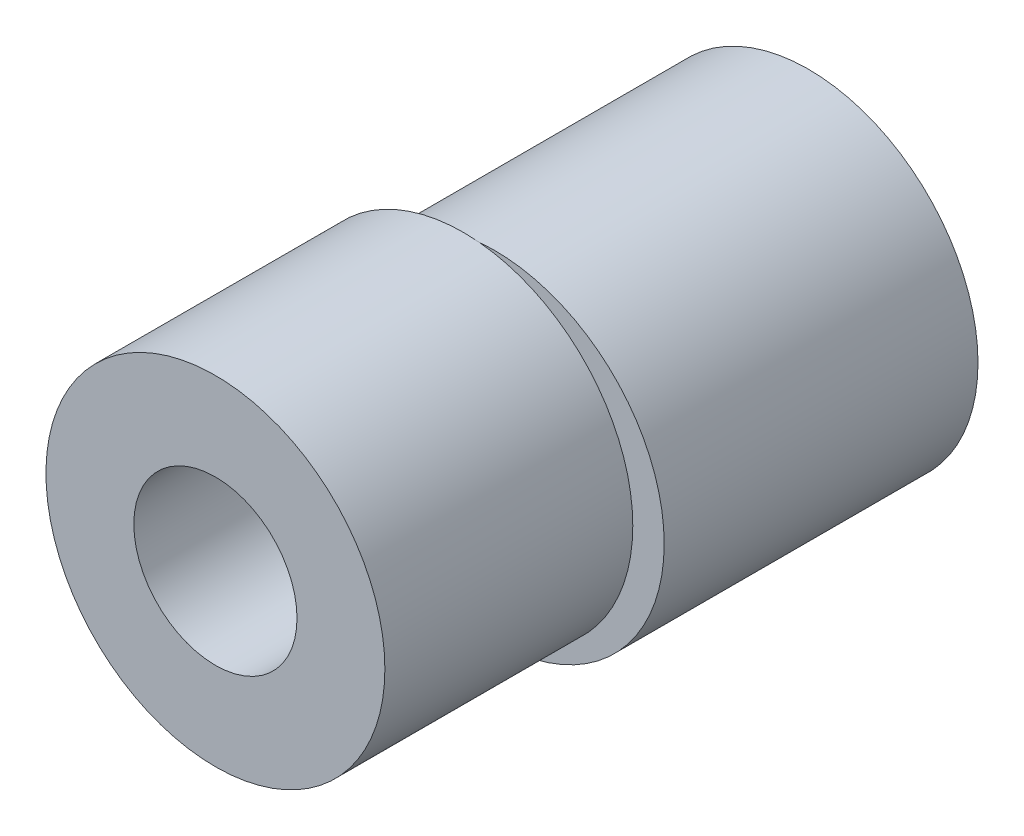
ISO-10303-21;
HEADER;
FILE_DESCRIPTION(('STEP AP214'),'2;1');
FILE_NAME('part.step','',(''),(''),'','','');
FILE_SCHEMA(('AUTOMOTIVE_DESIGN { 1 0 10303 214 1 1 1 1 }'));
ENDSEC;
DATA;
#1=APPLICATION_CONTEXT('core data for automotive mechanical design processes');
#2=APPLICATION_PROTOCOL_DEFINITION('international standard','automotive_design',2000,#1);
#3=PRODUCT_CONTEXT('',#1,'mechanical');
#4=PRODUCT('Part','Part','',(#3));
#5=PRODUCT_RELATED_PRODUCT_CATEGORY('part','',(#4));
#6=PRODUCT_DEFINITION_FORMATION('','',#4);
#7=PRODUCT_DEFINITION_CONTEXT('part definition',#1,'design');
#8=PRODUCT_DEFINITION('design','',#6,#7);
#9=PRODUCT_DEFINITION_SHAPE('','',#8);
#10=(LENGTH_UNIT() NAMED_UNIT(*) SI_UNIT(.MILLI.,.METRE.));
#11=(NAMED_UNIT(*) PLANE_ANGLE_UNIT() SI_UNIT($,.RADIAN.));
#12=(NAMED_UNIT(*) SI_UNIT($,.STERADIAN.) SOLID_ANGLE_UNIT());
#13=UNCERTAINTY_MEASURE_WITH_UNIT(LENGTH_MEASURE(1.E-05),#10,'distance_accuracy_value','');
#14=(GEOMETRIC_REPRESENTATION_CONTEXT(3) GLOBAL_UNCERTAINTY_ASSIGNED_CONTEXT((#13)) GLOBAL_UNIT_ASSIGNED_CONTEXT((#10,
#11,#12)) REPRESENTATION_CONTEXT('',''));
#15=CARTESIAN_POINT('',(0.,0.,0.));
#16=DIRECTION('',(0.,0.,1.));
#17=DIRECTION('',(1.,0.,0.));
#18=AXIS2_PLACEMENT_3D('',#15,#16,#17);
#19=CARTESIAN_POINT('',(0.,0.,10.));
#20=DIRECTION('',(0.,0.,-1.));
#21=DIRECTION('',(-1.,0.,0.));
#22=AXIS2_PLACEMENT_3D('',#19,#20,#21);
#23=CYLINDRICAL_SURFACE('',#22,5.4);
#24=CARTESIAN_POINT('',(0.,0.,10.));
#25=DIRECTION('',(0.,0.,1.));
#26=DIRECTION('',(1.,0.,0.));
#27=AXIS2_PLACEMENT_3D('',#24,#25,#26);
#28=CIRCLE('',#27,5.4);
#29=CARTESIAN_POINT('',(-0.5,5.37680202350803,10.));
#30=VERTEX_POINT('',#29);
#31=CARTESIAN_POINT('',(-0.5,-5.37680202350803,10.));
#32=VERTEX_POINT('',#31);
#33=EDGE_CURVE('E131',#30,#32,#28,.T.);
#34=ORIENTED_EDGE('',*,*,#33,.F.);
#35=EDGE_CURVE('E135',#32,#30,#28,.T.);
#36=ORIENTED_EDGE('',*,*,#35,.F.);
#37=EDGE_LOOP('',(#34,#36));
#38=FACE_BOUND('',#37,.T.);
#39=CARTESIAN_POINT('',(0.,0.,0.));
#40=DIRECTION('',(0.,0.,1.));
#41=DIRECTION('',(1.,0.,0.));
#42=AXIS2_PLACEMENT_3D('',#39,#40,#41);
#43=CIRCLE('',#42,5.4);
#44=CARTESIAN_POINT('',(5.4,0.,0.));
#45=VERTEX_POINT('',#44);
#46=EDGE_CURVE('E125',#45,#45,#43,.T.);
#47=ORIENTED_EDGE('',*,*,#46,.T.);
#48=EDGE_LOOP('',(#47));
#49=FACE_BOUND('',#48,.T.);
#50=ADVANCED_FACE('F42',(#38,#49),#23,.T.);
#51=CARTESIAN_POINT('',(0.,0.,10.));
#52=DIRECTION('',(0.,0.,1.));
#53=DIRECTION('',(1.,0.,0.));
#54=AXIS2_PLACEMENT_3D('',#51,#52,#53);
#55=PLANE('',#54);
#56=CARTESIAN_POINT('',(-1.,0.,10.));
#57=DIRECTION('',(0.,0.,1.));
#58=DIRECTION('',(1.,0.,0.));
#59=AXIS2_PLACEMENT_3D('',#56,#57,#58);
#60=CIRCLE('',#59,5.4);
#61=EDGE_CURVE('E130',#32,#30,#60,.T.);
#62=ORIENTED_EDGE('',*,*,#61,.F.);
#63=ORIENTED_EDGE('',*,*,#35,.T.);
#64=EDGE_LOOP('',(#62,#63));
#65=FACE_BOUND('',#64,.T.);
#66=ADVANCED_FACE('F170',(#65),#55,.T.);
#67=CARTESIAN_POINT('',(0.,0.,0.));
#68=DIRECTION('',(0.,0.,1.));
#69=DIRECTION('',(1.,0.,0.));
#70=AXIS2_PLACEMENT_3D('',#67,#68,#69);
#71=PLANE('',#70);
#72=DIRECTION('',(0.,-1.,0.));
#73=VECTOR('',#72,1.);
#74=CARTESIAN_POINT('',(-3.075,1.56664450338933,0.));
#75=LINE('',#74,#73);
#76=CARTESIAN_POINT('',(-3.075,1.56664450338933,0.));
#77=VERTEX_POINT('',#76);
#78=CARTESIAN_POINT('',(-3.075,-1.56664450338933,0.));
#79=VERTEX_POINT('',#78);
#80=EDGE_CURVE('E90',#77,#79,#75,.T.);
#81=ORIENTED_EDGE('',*,*,#80,.T.);
#82=CARTESIAN_POINT('',(-1.,0.,0.));
#83=DIRECTION('',(0.,0.,1.));
#84=DIRECTION('',(1.,0.,0.));
#85=AXIS2_PLACEMENT_3D('',#82,#83,#84);
#86=CIRCLE('',#85,2.6);
#87=EDGE_CURVE('E85',#77,#79,#86,.F.);
#88=ORIENTED_EDGE('',*,*,#87,.F.);
#89=EDGE_LOOP('',(#81,#88));
#90=FACE_BOUND('',#89,.T.);
#91=DIRECTION('',(0.,1.,0.));
#92=VECTOR('',#91,1.);
#93=CARTESIAN_POINT('',(-3.575,1.56664450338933,0.));
#94=LINE('',#93,#92);
#95=CARTESIAN_POINT('',(-3.575,-0.359687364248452,0.));
#96=VERTEX_POINT('',#95);
#97=CARTESIAN_POINT('',(-3.575,0.359687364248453,0.));
#98=VERTEX_POINT('',#97);
#99=EDGE_CURVE('E109',#96,#98,#94,.T.);
#100=ORIENTED_EDGE('',*,*,#99,.T.);
#101=EDGE_CURVE('E92',#96,#98,#86,.F.);
#102=ORIENTED_EDGE('',*,*,#101,.F.);
#103=EDGE_LOOP('',(#100,#102));
#104=FACE_BOUND('',#103,.T.);
#105=ORIENTED_EDGE('',*,*,#46,.F.);
#106=EDGE_LOOP('',(#105));
#107=FACE_BOUND('',#106,.T.);
#108=ADVANCED_FACE('F87',(#90,#104,#107),#71,.F.);
#109=CARTESIAN_POINT('',(-1.,0.,10.));
#110=DIRECTION('',(0.,0.,1.));
#111=DIRECTION('',(1.,0.,0.));
#112=AXIS2_PLACEMENT_3D('',#109,#110,#111);
#113=PLANE('',#112);
#114=EDGE_CURVE('E126',#30,#32,#60,.T.);
#115=ORIENTED_EDGE('',*,*,#114,.F.);
#116=ORIENTED_EDGE('',*,*,#33,.T.);
#117=EDGE_LOOP('',(#115,#116));
#118=FACE_BOUND('',#117,.T.);
#119=ADVANCED_FACE('F167',(#118),#113,.F.);
#120=CARTESIAN_POINT('',(-1.,0.,17.9));
#121=DIRECTION('',(0.,0.,-1.));
#122=DIRECTION('',(-1.,0.,0.));
#123=AXIS2_PLACEMENT_3D('',#120,#121,#122);
#124=CYLINDRICAL_SURFACE('',#123,5.4);
#125=CARTESIAN_POINT('',(-1.,0.,17.9));
#126=DIRECTION('',(0.,0.,1.));
#127=DIRECTION('',(1.,0.,0.));
#128=AXIS2_PLACEMENT_3D('',#125,#126,#127);
#129=CIRCLE('',#128,5.4);
#130=CARTESIAN_POINT('',(4.4,0.,17.9));
#131=VERTEX_POINT('',#130);
#132=EDGE_CURVE('E121',#131,#131,#129,.T.);
#133=ORIENTED_EDGE('',*,*,#132,.F.);
#134=EDGE_LOOP('',(#133));
#135=FACE_BOUND('',#134,.T.);
#136=ORIENTED_EDGE('',*,*,#114,.T.);
#137=ORIENTED_EDGE('',*,*,#61,.T.);
#138=EDGE_LOOP('',(#136,#137));
#139=FACE_BOUND('',#138,.T.);
#140=ADVANCED_FACE('F163',(#135,#139),#124,.T.);
#141=CARTESIAN_POINT('',(-1.,0.,17.9));
#142=DIRECTION('',(0.,0.,1.));
#143=DIRECTION('',(1.,0.,0.));
#144=AXIS2_PLACEMENT_3D('',#141,#142,#143);
#145=PLANE('',#144);
#146=CARTESIAN_POINT('',(-1.,0.,17.9));
#147=DIRECTION('',(0.,0.,1.));
#148=DIRECTION('',(1.,0.,0.));
#149=AXIS2_PLACEMENT_3D('',#146,#147,#148);
#150=CIRCLE('',#149,2.6);
#151=CARTESIAN_POINT('',(1.6,0.,17.9));
#152=VERTEX_POINT('',#151);
#153=EDGE_CURVE('E93',#152,#152,#150,.T.);
#154=ORIENTED_EDGE('',*,*,#153,.F.);
#155=EDGE_LOOP('',(#154));
#156=FACE_BOUND('',#155,.T.);
#157=ORIENTED_EDGE('',*,*,#132,.T.);
#158=EDGE_LOOP('',(#157));
#159=FACE_BOUND('',#158,.T.);
#160=ADVANCED_FACE('F180',(#156,#159),#145,.T.);
#161=CARTESIAN_POINT('',(-1.,0.,-0.001000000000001));
#162=DIRECTION('',(0.,0.,1.));
#163=DIRECTION('',(1.,0.,0.));
#164=AXIS2_PLACEMENT_3D('',#161,#162,#163);
#165=CYLINDRICAL_SURFACE('',#164,2.6);
#166=ORIENTED_EDGE('',*,*,#87,.T.);
#167=DIRECTION('',(0.,0.,1.));
#168=VECTOR('',#167,1.);
#169=CARTESIAN_POINT('',(-3.075,-1.56664450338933,-0.001000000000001));
#170=LINE('',#169,#168);
#171=CARTESIAN_POINT('',(-3.075,-1.56664450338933,7.9));
#172=VERTEX_POINT('',#171);
#173=EDGE_CURVE('E11',#79,#172,#170,.T.);
#174=ORIENTED_EDGE('',*,*,#173,.T.);
#175=CARTESIAN_POINT('',(-1.,0.,7.9));
#176=DIRECTION('',(0.,0.,-1.));
#177=DIRECTION('',(-1.,0.,0.));
#178=AXIS2_PLACEMENT_3D('',#175,#176,#177);
#179=CIRCLE('',#178,2.6);
#180=CARTESIAN_POINT('',(-3.575,-0.359687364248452,7.9));
#181=VERTEX_POINT('',#180);
#182=EDGE_CURVE('E59',#181,#172,#179,.F.);
#183=ORIENTED_EDGE('',*,*,#182,.F.);
#184=DIRECTION('',(0.,0.,1.));
#185=VECTOR('',#184,1.);
#186=CARTESIAN_POINT('',(-3.575,-0.359687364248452,-0.001000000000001));
#187=LINE('',#186,#185);
#188=EDGE_CURVE('E50',#181,#96,#187,.F.);
#189=ORIENTED_EDGE('',*,*,#188,.T.);
#190=ORIENTED_EDGE('',*,*,#101,.T.);
#191=DIRECTION('',(0.,0.,1.));
#192=VECTOR('',#191,1.);
#193=CARTESIAN_POINT('',(-3.575,0.359687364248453,-0.001000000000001));
#194=LINE('',#193,#192);
#195=CARTESIAN_POINT('',(-3.575,0.359687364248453,7.9));
#196=VERTEX_POINT('',#195);
#197=EDGE_CURVE('E141',#98,#196,#194,.T.);
#198=ORIENTED_EDGE('',*,*,#197,.T.);
#199=CARTESIAN_POINT('',(-3.075,1.56664450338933,7.9));
#200=VERTEX_POINT('',#199);
#201=EDGE_CURVE('E100',#200,#196,#179,.F.);
#202=ORIENTED_EDGE('',*,*,#201,.F.);
#203=DIRECTION('',(0.,0.,-1.));
#204=VECTOR('',#203,1.);
#205=CARTESIAN_POINT('',(-3.075,1.56664450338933,7.9));
#206=LINE('',#205,#204);
#207=EDGE_CURVE('E96',#200,#77,#206,.T.);
#208=ORIENTED_EDGE('',*,*,#207,.T.);
#209=EDGE_LOOP('',(#166,#174,#183,#189,#190,#198,#202,#208));
#210=FACE_BOUND('',#209,.T.);
#211=ORIENTED_EDGE('',*,*,#153,.T.);
#212=EDGE_LOOP('',(#211));
#213=FACE_BOUND('',#212,.T.);
#214=ADVANCED_FACE('F97',(#210,#213),#165,.F.);
#215=CARTESIAN_POINT('',(-3.075,1.56664450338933,7.9));
#216=DIRECTION('',(1.,0.,0.));
#217=DIRECTION('',(0.,1.,0.));
#218=AXIS2_PLACEMENT_3D('',#215,#216,#217);
#219=PLANE('',#218);
#220=ORIENTED_EDGE('',*,*,#173,.F.);
#221=ORIENTED_EDGE('',*,*,#80,.F.);
#222=ORIENTED_EDGE('',*,*,#207,.F.);
#223=DIRECTION('',(0.,-1.,0.));
#224=VECTOR('',#223,1.);
#225=CARTESIAN_POINT('',(-3.075,1.56664450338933,7.9));
#226=LINE('',#225,#224);
#227=EDGE_CURVE('E113',#200,#172,#226,.T.);
#228=ORIENTED_EDGE('',*,*,#227,.T.);
#229=EDGE_LOOP('',(#220,#221,#222,#228));
#230=FACE_BOUND('',#229,.T.);
#231=ADVANCED_FACE('F107',(#230),#219,.T.);
#232=CARTESIAN_POINT('',(-3.575,1.56664450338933,7.9));
#233=DIRECTION('',(-1.,0.,0.));
#234=DIRECTION('',(0.,-1.,0.));
#235=AXIS2_PLACEMENT_3D('',#232,#233,#234);
#236=PLANE('',#235);
#237=ORIENTED_EDGE('',*,*,#188,.F.);
#238=DIRECTION('',(0.,1.,0.));
#239=VECTOR('',#238,1.);
#240=CARTESIAN_POINT('',(-3.575,1.56664450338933,7.9));
#241=LINE('',#240,#239);
#242=EDGE_CURVE('E105',#181,#196,#241,.T.);
#243=ORIENTED_EDGE('',*,*,#242,.T.);
#244=ORIENTED_EDGE('',*,*,#197,.F.);
#245=ORIENTED_EDGE('',*,*,#99,.F.);
#246=EDGE_LOOP('',(#237,#243,#244,#245));
#247=FACE_BOUND('',#246,.T.);
#248=ADVANCED_FACE('F154',(#247),#236,.T.);
#249=CARTESIAN_POINT('',(0.,0.,7.9));
#250=DIRECTION('',(0.,0.,-1.));
#251=DIRECTION('',(-1.,0.,0.));
#252=AXIS2_PLACEMENT_3D('',#249,#250,#251);
#253=PLANE('',#252);
#254=ORIENTED_EDGE('',*,*,#242,.F.);
#255=ORIENTED_EDGE('',*,*,#182,.T.);
#256=ORIENTED_EDGE('',*,*,#227,.F.);
#257=ORIENTED_EDGE('',*,*,#201,.T.);
#258=EDGE_LOOP('',(#254,#255,#256,#257));
#259=FACE_BOUND('',#258,.T.);
#260=ADVANCED_FACE('F148',(#259),#253,.F.);
#261=CLOSED_SHELL('',(#50,#66,#108,#119,#140,#160,#214,#231,#248,#260));
#262=MANIFOLD_SOLID_BREP('B2',#261);
#263=ADVANCED_BREP_SHAPE_REPRESENTATION('',(#18,#262),#14);
#264=SHAPE_DEFINITION_REPRESENTATION(#9,#263);
ENDSEC;
END-ISO-10303-21;
